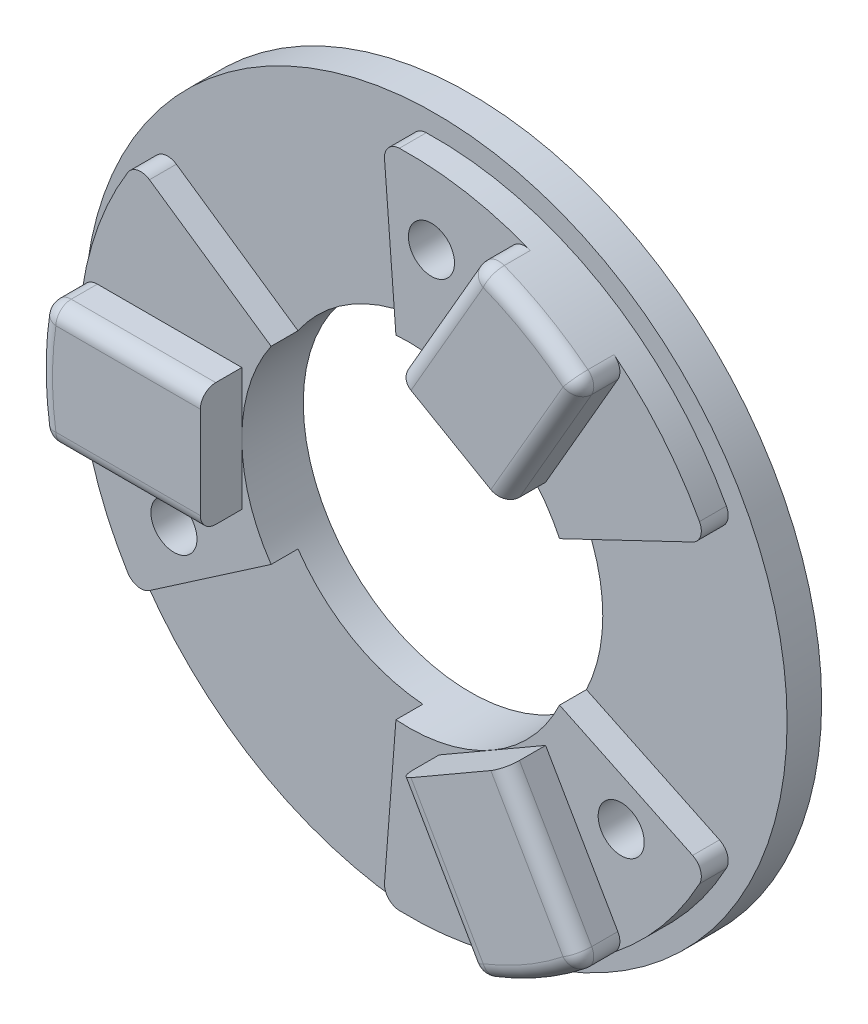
from build123d import *
from build123d.topology import SkipClean

# Parameters (mm, degrees)
SKETCH1_R                = 22.875
SKETCH1_R_2              = 10.875
EXTRUDE1_DEPTH           = 2.25
EXTRUDE2_DEPTH           = 1.75
EXTRUDE3_DEPTH           = 2.7
FILLET1_R                = 1
SKETCH6_R                = 1.5
CUT_EXTRUDE1_DEPTH       = 33.596491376
SKETCH7_R                = 3.375
EXTRUDE5_DEPTH           = 0.5
SKETCH9_R                = 4.625
CUT_EXTRUDE3_DEPTH       = 0.5
SKETCH10_R               = 3
EXTRUDE6_DEPTH           = 0.4
CIRPATTERN1_COUNT        = 3
FILLET1_OF_CIRPATTERN1_R = 1


with BuildPart() as part:
    # Sketch1 → Extrude1 (new body)
    with BuildSketch(Plane.XY):
        Circle(SKETCH1_R)
        Circle(SKETCH1_R_2, mode=Mode.SUBTRACT)
    extrude(amount=EXTRUDE1_DEPTH)

    # Sketch3 → Extrude2 (add)
    with BuildSketch(Plane.XY.offset(2.25)):
        with BuildLine():
            Line((-0.84209183, -10.842347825), (-1.664825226, -21.435446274))
            ThreePointArc((-1.664825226, -21.435446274), (10.75, -18.619546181), (19.396053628, -9.275942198))
            Line((19.396053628, -9.275942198), (9.810794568, -4.691900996))
            ThreePointArc((9.810794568, -4.691900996), (5.4375, -9.418026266), (-0.84209183, -10.842347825))
        make_face()
    extrude2 = extrude(amount=EXTRUDE2_DEPTH)

    # Sketch4 → Extrude3 (add)
    with BuildSketch(Plane.XY.offset(4)):
        with BuildLine():
            Line((1.973398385, -11.418026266), (8.901601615, -7.418026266))
            Line((8.901601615, -7.418026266), (14.026416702, -16.294466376))
            ThreePointArc((14.026416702, -16.294466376), (10.75, -18.619546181), (7.098213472, -20.294466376))
            Line((7.098213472, -20.294466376), (1.973398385, -11.418026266))
        make_face()
    extrude3 = extrude(amount=EXTRUDE3_DEPTH)

    # Fillet1
    fillet1_edges = [part.edges().sort_by_distance(p)[0] for p in [
        (19.396053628, -9.275942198, 3.125),
        (-1.664825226, -21.435446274, 3.125),
        (10.75, -18.619546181, 6.7),
        (11.464009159, -11.856246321, 6.7),
        (4.535805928, -15.856246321, 6.7),
        (14.026416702, -16.294466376, 5.35),
        (7.098213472, -20.294466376, 5.35),
    ]]
    fillet(fillet1_edges, radius=FILLET1_R)

    # Sketch6 → Cut-Extrude1 (cut, through all)
    with BuildSketch(Plane.XY.offset(4)):
        with Locations((13.823190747, -9.679102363)):
            Circle(SKETCH6_R)
    cut_extrude1 = extrude(amount=-CUT_EXTRUDE1_DEPTH, mode=Mode.SUBTRACT)

    # Sketch7 → Extrude5 (add)
    with BuildSketch(Plane(origin=(0, 0, 0), x_dir=(-1, 0, 0), z_dir=(0, 0, -1))):
        with Locations(Location((-8.5, -14.722431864, 0), (0, 0, 180))):
            Circle(SKETCH7_R)
    extrude5 = extrude(amount=EXTRUDE5_DEPTH)

    # Sketch9 → Cut-Extrude3 (cut)
    with BuildSketch(Plane(origin=(0, 0, 0), x_dir=(-1, 0, 0), z_dir=(0, 0, -1))):
        with Locations((-16.875, 0)):
            Circle(SKETCH9_R)
    cut_extrude3 = extrude(amount=-CUT_EXTRUDE3_DEPTH, mode=Mode.SUBTRACT)

    # Sketch10 → Extrude6 (add)
    with BuildSketch(Plane(origin=(0, 0, 0.5), x_dir=(-1, 0, 0), z_dir=(0, 0, -1))):
        with Locations((-16.875, 0)):
            Circle(SKETCH10_R)
    extrude6 = extrude(amount=EXTRUDE6_DEPTH)

    # CirPattern1: Extrude2, Extrude3, Cut-Extrude1, Extrude5, Cut-Extrude3, Extrude6 ×3 about axis
    with SkipClean():  # the faces are left unmerged after this step: merging them gives an invalid solid
        cirpattern1_axis = Axis((0, 0, 0), (0, 0, 1))
        add([extrude2.rotate(cirpattern1_axis, i * 360 / CIRPATTERN1_COUNT) for i in range(1, CIRPATTERN1_COUNT)])
        add([extrude3.rotate(cirpattern1_axis, i * 360 / CIRPATTERN1_COUNT) for i in range(1, CIRPATTERN1_COUNT)])
        add([cut_extrude1.rotate(cirpattern1_axis, i * 360 / CIRPATTERN1_COUNT) for i in range(1, CIRPATTERN1_COUNT)], mode=Mode.SUBTRACT)
        add([extrude5.rotate(cirpattern1_axis, i * 360 / CIRPATTERN1_COUNT) for i in range(1, CIRPATTERN1_COUNT)])
        add([cut_extrude3.rotate(cirpattern1_axis, i * 360 / CIRPATTERN1_COUNT) for i in range(1, CIRPATTERN1_COUNT)], mode=Mode.SUBTRACT)
        add([extrude6.rotate(cirpattern1_axis, i * 360 / CIRPATTERN1_COUNT) for i in range(1, CIRPATTERN1_COUNT)])

    # Fillet1 of CirPattern1
    fillet1_of_cirpattern1_edges = [part.edges().sort_by_distance(p)[0] for p in [
        (-1.664825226, 21.435446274, 3.125),
        (19.396053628, 9.275942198, 3.125),
        (10.75, 18.619546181, 6.7),
        (4.535805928, 15.856246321, 6.7),
        (11.464009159, 11.856246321, 6.7),
        (7.098213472, 20.294466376, 5.35),
        (14.026416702, 16.294466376, 5.35),
        (-17.731228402, -12.159504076, 3.125),
        (-17.731228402, 12.159504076, 3.125),
        (-21.5, 0, 6.7),
        (-15.999815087, -4, 6.7),
        (-15.999815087, 4, 6.7),
        (-21.124630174, -4, 5.35),
        (-21.124630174, 4, 5.35),
    ]]
    fillet(fillet1_of_cirpattern1_edges, radius=FILLET1_OF_CIRPATTERN1_R)


solid = part.part
